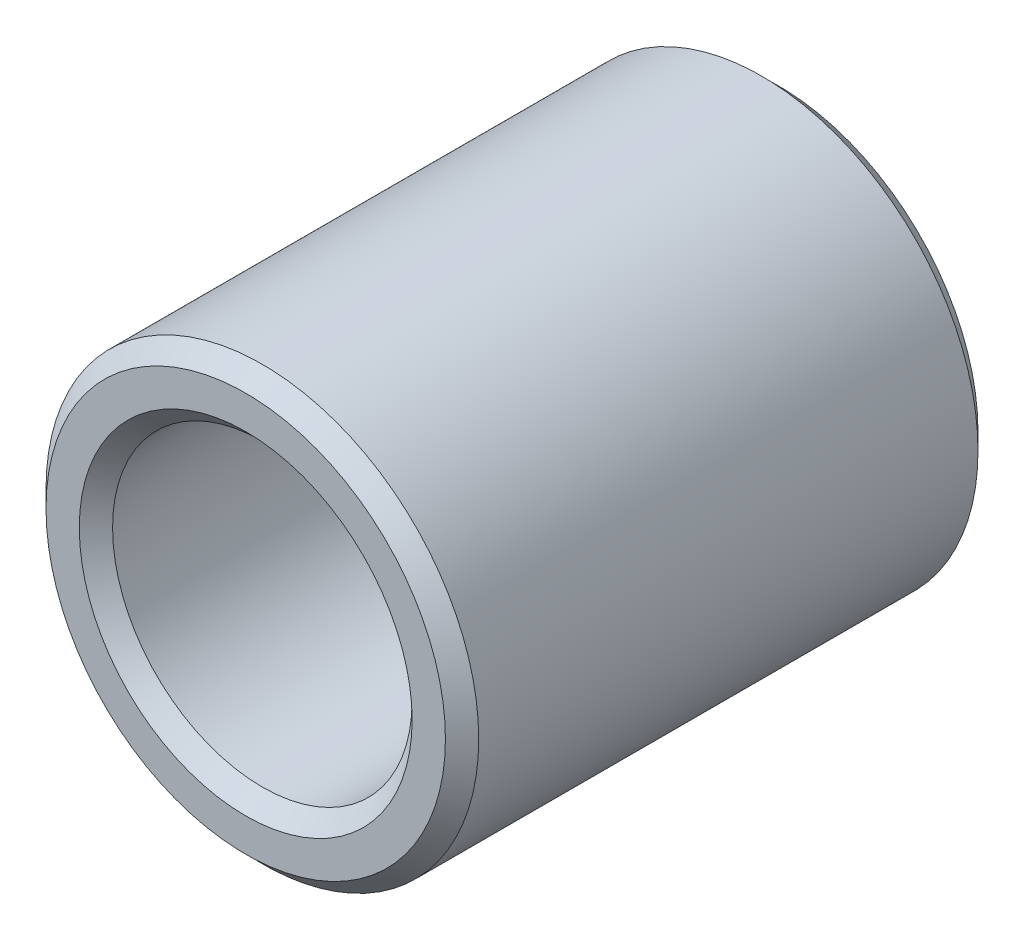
from build123d import *

# Parameters (mm, degrees)
ESQUISSE1_R          = 6.5
ESQUISSE1_R_2        = 4.5
BASE_EXTRUSION_DEPTH = 16
CHANFREIN1_SIZE      = 0.5


with BuildPart() as part:
    # Esquisse1 → Base-Extrusion (new body)
    with BuildSketch(Plane.XY):
        Circle(ESQUISSE1_R)
        Circle(ESQUISSE1_R_2, mode=Mode.SUBTRACT)
    extrude(amount=BASE_EXTRUSION_DEPTH)

    # Chanfrein1
    chanfrein1_edges = [part.edges().sort_by_distance(p)[0] for p in [
        (-6.5, 0, 0),
        (-6.5, 0, 16),
        (-4.5, 0, 0),
        (-4.5, 0, 16),
    ]]
    chamfer(chanfrein1_edges, length=CHANFREIN1_SIZE)


solid = part.part
